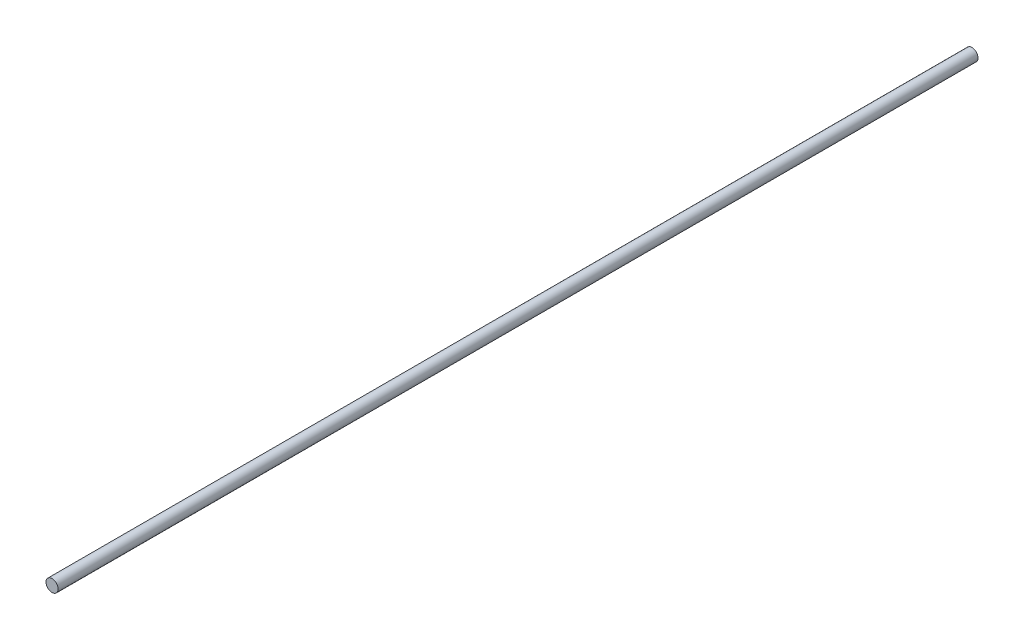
from build123d import *

# Parameters (mm, degrees)
SKETCH1_R           = 30
BOSS_EXTRUDE1_DEPTH = 4550


with BuildPart() as part:
    # Sketch1 → Boss-Extrude1 (new body)
    with BuildSketch(Plane.XY):
        Circle(SKETCH1_R)
    extrude(amount=-BOSS_EXTRUDE1_DEPTH)


solid = part.part
